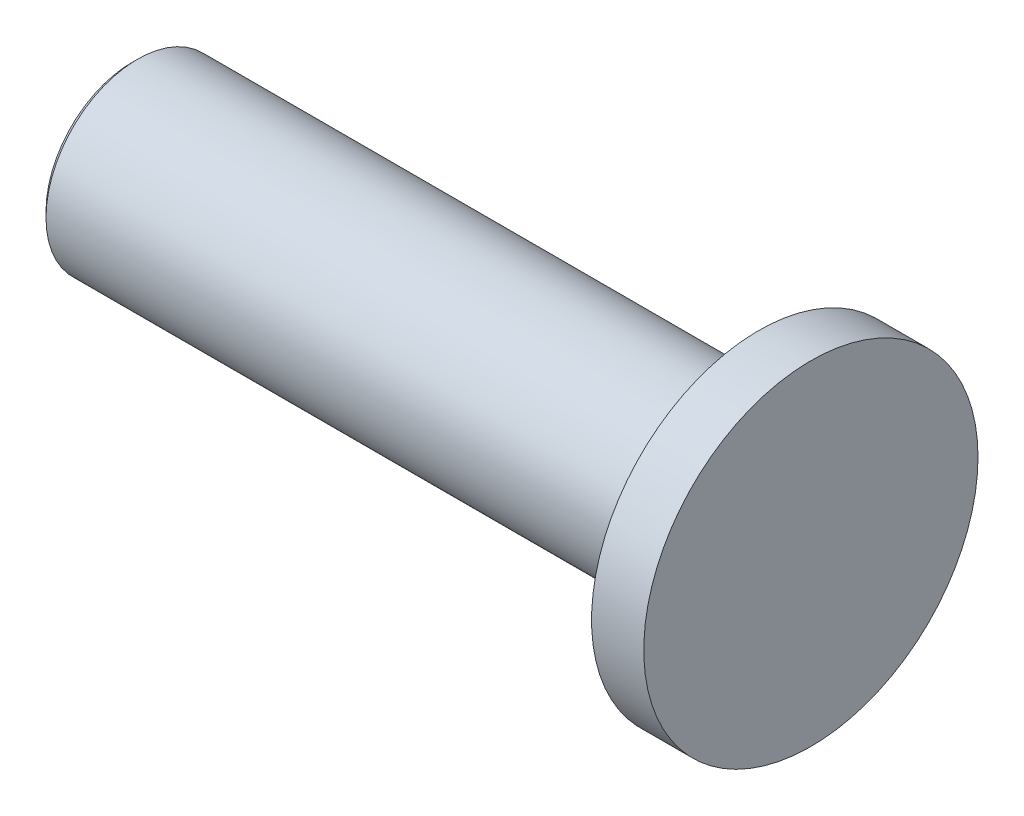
ISO-10303-21;
HEADER;
FILE_DESCRIPTION(('STEP AP214'),'2;1');
FILE_NAME('part.step','',(''),(''),'','','');
FILE_SCHEMA(('AUTOMOTIVE_DESIGN { 1 0 10303 214 1 1 1 1 }'));
ENDSEC;
DATA;
#1=APPLICATION_CONTEXT('core data for automotive mechanical design processes');
#2=APPLICATION_PROTOCOL_DEFINITION('international standard','automotive_design',2000,#1);
#3=PRODUCT_CONTEXT('',#1,'mechanical');
#4=PRODUCT('Part','Part','',(#3));
#5=PRODUCT_RELATED_PRODUCT_CATEGORY('part','',(#4));
#6=PRODUCT_DEFINITION_FORMATION('','',#4);
#7=PRODUCT_DEFINITION_CONTEXT('part definition',#1,'design');
#8=PRODUCT_DEFINITION('design','',#6,#7);
#9=PRODUCT_DEFINITION_SHAPE('','',#8);
#10=(LENGTH_UNIT() NAMED_UNIT(*) SI_UNIT(.MILLI.,.METRE.));
#11=(NAMED_UNIT(*) PLANE_ANGLE_UNIT() SI_UNIT($,.RADIAN.));
#12=(NAMED_UNIT(*) SI_UNIT($,.STERADIAN.) SOLID_ANGLE_UNIT());
#13=UNCERTAINTY_MEASURE_WITH_UNIT(LENGTH_MEASURE(1.E-05),#10,'distance_accuracy_value','');
#14=(GEOMETRIC_REPRESENTATION_CONTEXT(3) GLOBAL_UNCERTAINTY_ASSIGNED_CONTEXT((#13)) GLOBAL_UNIT_ASSIGNED_CONTEXT((#10,
#11,#12)) REPRESENTATION_CONTEXT('',''));
#15=CARTESIAN_POINT('',(0.,0.,0.));
#16=DIRECTION('',(0.,0.,1.));
#17=DIRECTION('',(1.,0.,0.));
#18=AXIS2_PLACEMENT_3D('',#15,#16,#17);
#19=CARTESIAN_POINT('',(112.125,0.,0.));
#20=DIRECTION('',(1.,0.,0.));
#21=DIRECTION('',(0.,0.,-1.));
#22=AXIS2_PLACEMENT_3D('',#19,#20,#21);
#23=CYLINDRICAL_SURFACE('',#22,60.);
#24=CARTESIAN_POINT('',(112.125,0.,0.));
#25=DIRECTION('',(1.,0.,0.));
#26=DIRECTION('',(0.,0.,-1.));
#27=AXIS2_PLACEMENT_3D('',#24,#25,#26);
#28=CIRCLE('',#27,60.);
#29=CARTESIAN_POINT('',(112.125,0.,-60.));
#30=VERTEX_POINT('',#29);
#31=EDGE_CURVE('E65',#30,#30,#28,.T.);
#32=ORIENTED_EDGE('',*,*,#31,.T.);
#33=EDGE_LOOP('',(#32));
#34=FACE_BOUND('',#33,.T.);
#35=CARTESIAN_POINT('',(130.875,0.,0.));
#36=DIRECTION('',(1.,0.,0.));
#37=DIRECTION('',(0.,0.,-1.));
#38=AXIS2_PLACEMENT_3D('',#35,#36,#37);
#39=CIRCLE('',#38,60.);
#40=CARTESIAN_POINT('',(130.875,0.,-60.));
#41=VERTEX_POINT('',#40);
#42=EDGE_CURVE('E71',#41,#41,#39,.T.);
#43=ORIENTED_EDGE('',*,*,#42,.F.);
#44=EDGE_LOOP('',(#43));
#45=FACE_BOUND('',#44,.T.);
#46=ADVANCED_FACE('F46',(#34,#45),#23,.T.);
#47=CARTESIAN_POINT('',(112.125,60.,0.));
#48=DIRECTION('',(-1.,0.,0.));
#49=DIRECTION('',(0.,0.,1.));
#50=AXIS2_PLACEMENT_3D('',#47,#48,#49);
#51=PLANE('',#50);
#52=CARTESIAN_POINT('',(112.125,0.,0.));
#53=DIRECTION('',(-1.,0.,0.));
#54=DIRECTION('',(0.,0.,1.));
#55=AXIS2_PLACEMENT_3D('',#52,#53,#54);
#56=CIRCLE('',#55,32.88);
#57=CARTESIAN_POINT('',(112.125,0.,32.88));
#58=VERTEX_POINT('',#57);
#59=EDGE_CURVE('E60',#58,#58,#56,.T.);
#60=ORIENTED_EDGE('',*,*,#59,.F.);
#61=EDGE_LOOP('',(#60));
#62=FACE_BOUND('',#61,.T.);
#63=ORIENTED_EDGE('',*,*,#31,.F.);
#64=EDGE_LOOP('',(#63));
#65=FACE_BOUND('',#64,.T.);
#66=ADVANCED_FACE('F79',(#62,#65),#51,.T.);
#67=CARTESIAN_POINT('',(130.875,0.,0.));
#68=DIRECTION('',(1.,0.,0.));
#69=DIRECTION('',(0.,0.,-1.));
#70=AXIS2_PLACEMENT_3D('',#67,#68,#69);
#71=PLANE('',#70);
#72=ORIENTED_EDGE('',*,*,#42,.T.);
#73=EDGE_LOOP('',(#72));
#74=FACE_BOUND('',#73,.T.);
#75=ADVANCED_FACE('F76',(#74),#71,.T.);
#76=CARTESIAN_POINT('',(-112.875,0.,0.));
#77=DIRECTION('',(1.,0.,0.));
#78=DIRECTION('',(0.,0.,-1.));
#79=AXIS2_PLACEMENT_3D('',#76,#77,#78);
#80=CYLINDRICAL_SURFACE('',#79,32.88);
#81=CARTESIAN_POINT('',(-110.875,0.,0.));
#82=DIRECTION('',(-1.,0.,0.));
#83=DIRECTION('',(0.,0.,1.));
#84=AXIS2_PLACEMENT_3D('',#81,#82,#83);
#85=CIRCLE('',#84,32.88);
#86=CARTESIAN_POINT('',(-110.875,0.,32.88));
#87=VERTEX_POINT('',#86);
#88=EDGE_CURVE('E11',#87,#87,#85,.F.);
#89=ORIENTED_EDGE('',*,*,#88,.T.);
#90=EDGE_LOOP('',(#89));
#91=FACE_BOUND('',#90,.T.);
#92=ORIENTED_EDGE('',*,*,#59,.T.);
#93=EDGE_LOOP('',(#92));
#94=FACE_BOUND('',#93,.T.);
#95=ADVANCED_FACE('F89',(#91,#94),#80,.T.);
#96=CARTESIAN_POINT('',(-112.875,0.,0.));
#97=DIRECTION('',(-1.,0.,0.));
#98=DIRECTION('',(0.,0.,1.));
#99=AXIS2_PLACEMENT_3D('',#96,#97,#98);
#100=PLANE('',#99);
#101=CARTESIAN_POINT('',(-112.875,0.,0.));
#102=DIRECTION('',(-1.,0.,0.));
#103=DIRECTION('',(0.,0.,1.));
#104=AXIS2_PLACEMENT_3D('',#101,#102,#103);
#105=CIRCLE('',#104,30.88);
#106=CARTESIAN_POINT('',(-112.875,0.,30.88));
#107=VERTEX_POINT('',#106);
#108=EDGE_CURVE('E55',#107,#107,#105,.T.);
#109=ORIENTED_EDGE('',*,*,#108,.T.);
#110=EDGE_LOOP('',(#109));
#111=FACE_BOUND('',#110,.T.);
#112=ADVANCED_FACE('F92',(#111),#100,.T.);
#113=CARTESIAN_POINT('',(-112.875,0.,0.));
#114=DIRECTION('',(1.,0.,0.));
#115=DIRECTION('',(0.,0.,-1.));
#116=AXIS2_PLACEMENT_3D('',#113,#114,#115);
#117=CONICAL_SURFACE('',#116,30.88,0.785398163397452);
#118=ORIENTED_EDGE('',*,*,#88,.F.);
#119=EDGE_LOOP('',(#118));
#120=FACE_BOUND('',#119,.T.);
#121=ORIENTED_EDGE('',*,*,#108,.F.);
#122=EDGE_LOOP('',(#121));
#123=FACE_BOUND('',#122,.T.);
#124=ADVANCED_FACE('F49',(#120,#123),#117,.T.);
#125=CLOSED_SHELL('',(#46,#66,#75,#95,#112,#124));
#126=MANIFOLD_SOLID_BREP('B2',#125);
#127=ADVANCED_BREP_SHAPE_REPRESENTATION('',(#18,#126),#14);
#128=SHAPE_DEFINITION_REPRESENTATION(#9,#127);
ENDSEC;
END-ISO-10303-21;
